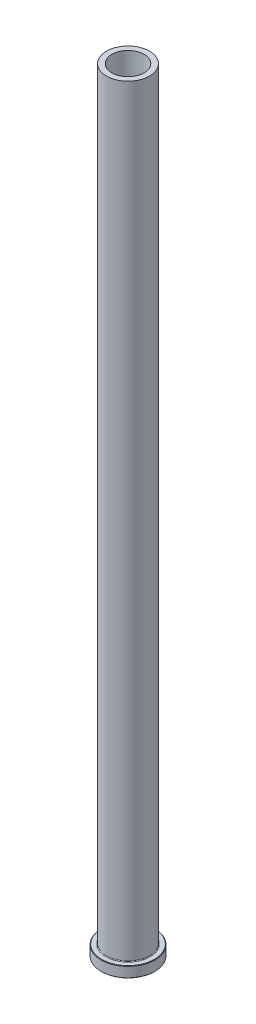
ISO-10303-21;
HEADER;
FILE_DESCRIPTION(('STEP AP214'),'2;1');
FILE_NAME('part.step','',(''),(''),'','','');
FILE_SCHEMA(('AUTOMOTIVE_DESIGN { 1 0 10303 214 1 1 1 1 }'));
ENDSEC;
DATA;
#1=APPLICATION_CONTEXT('core data for automotive mechanical design processes');
#2=APPLICATION_PROTOCOL_DEFINITION('international standard','automotive_design',2000,#1);
#3=PRODUCT_CONTEXT('',#1,'mechanical');
#4=PRODUCT('Part','Part','',(#3));
#5=PRODUCT_RELATED_PRODUCT_CATEGORY('part','',(#4));
#6=PRODUCT_DEFINITION_FORMATION('','',#4);
#7=PRODUCT_DEFINITION_CONTEXT('part definition',#1,'design');
#8=PRODUCT_DEFINITION('design','',#6,#7);
#9=PRODUCT_DEFINITION_SHAPE('','',#8);
#10=(LENGTH_UNIT() NAMED_UNIT(*) SI_UNIT(.MILLI.,.METRE.));
#11=(NAMED_UNIT(*) PLANE_ANGLE_UNIT() SI_UNIT($,.RADIAN.));
#12=(NAMED_UNIT(*) SI_UNIT($,.STERADIAN.) SOLID_ANGLE_UNIT());
#13=UNCERTAINTY_MEASURE_WITH_UNIT(LENGTH_MEASURE(1.E-05),#10,'distance_accuracy_value','');
#14=(GEOMETRIC_REPRESENTATION_CONTEXT(3) GLOBAL_UNCERTAINTY_ASSIGNED_CONTEXT((#13)) GLOBAL_UNIT_ASSIGNED_CONTEXT((#10,
#11,#12)) REPRESENTATION_CONTEXT('',''));
#15=CARTESIAN_POINT('',(0.,0.,0.));
#16=DIRECTION('',(0.,0.,1.));
#17=DIRECTION('',(1.,0.,0.));
#18=AXIS2_PLACEMENT_3D('',#15,#16,#17);
#19=CARTESIAN_POINT('',(0.,0.,0.));
#20=DIRECTION('',(0.,-1.,0.));
#21=DIRECTION('',(0.,0.,-1.));
#22=AXIS2_PLACEMENT_3D('',#19,#20,#21);
#23=PLANE('',#22);
#24=CARTESIAN_POINT('',(0.,0.,0.));
#25=DIRECTION('',(0.,-1.,0.));
#26=DIRECTION('',(0.,0.,-1.));
#27=AXIS2_PLACEMENT_3D('',#24,#25,#26);
#28=CIRCLE('',#27,15.621);
#29=CARTESIAN_POINT('',(0.,0.,-15.621));
#30=VERTEX_POINT('',#29);
#31=EDGE_CURVE('E45',#30,#30,#28,.T.);
#32=ORIENTED_EDGE('',*,*,#31,.T.);
#33=EDGE_LOOP('',(#32));
#34=FACE_BOUND('',#33,.T.);
#35=CARTESIAN_POINT('',(0.,0.,0.));
#36=DIRECTION('',(0.,-1.,0.));
#37=DIRECTION('',(0.,0.,-1.));
#38=AXIS2_PLACEMENT_3D('',#35,#36,#37);
#39=CIRCLE('',#38,10.112375);
#40=CARTESIAN_POINT('',(0.,0.,-10.112375));
#41=VERTEX_POINT('',#40);
#42=EDGE_CURVE('E59',#41,#41,#39,.T.);
#43=ORIENTED_EDGE('',*,*,#42,.F.);
#44=EDGE_LOOP('',(#43));
#45=FACE_BOUND('',#44,.T.);
#46=ADVANCED_FACE('F30',(#34,#45),#23,.T.);
#47=CARTESIAN_POINT('',(0.,0.,0.));
#48=DIRECTION('',(0.,-1.,0.));
#49=DIRECTION('',(0.,0.,-1.));
#50=AXIS2_PLACEMENT_3D('',#47,#48,#49);
#51=CYLINDRICAL_SURFACE('',#50,15.875);
#52=CARTESIAN_POINT('',(0.,0.254000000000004,0.));
#53=DIRECTION('',(0.,-1.,0.));
#54=DIRECTION('',(0.,0.,-1.));
#55=AXIS2_PLACEMENT_3D('',#52,#53,#54);
#56=CIRCLE('',#55,15.875);
#57=CARTESIAN_POINT('',(0.,0.254000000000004,-15.875));
#58=VERTEX_POINT('',#57);
#59=EDGE_CURVE('E37',#58,#58,#56,.F.);
#60=ORIENTED_EDGE('',*,*,#59,.T.);
#61=EDGE_LOOP('',(#60));
#62=FACE_BOUND('',#61,.T.);
#63=CARTESIAN_POINT('',(0.,6.09600000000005,0.));
#64=DIRECTION('',(0.,1.,0.));
#65=DIRECTION('',(0.,0.,1.));
#66=AXIS2_PLACEMENT_3D('',#63,#64,#65);
#67=CIRCLE('',#66,15.875);
#68=CARTESIAN_POINT('',(0.,6.09600000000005,15.875));
#69=VERTEX_POINT('',#68);
#70=EDGE_CURVE('E41',#69,#69,#67,.F.);
#71=ORIENTED_EDGE('',*,*,#70,.T.);
#72=EDGE_LOOP('',(#71));
#73=FACE_BOUND('',#72,.T.);
#74=ADVANCED_FACE('F104',(#62,#73),#51,.T.);
#75=CARTESIAN_POINT('',(15.875,6.35,0.));
#76=DIRECTION('',(0.,1.,0.));
#77=DIRECTION('',(0.,0.,1.));
#78=AXIS2_PLACEMENT_3D('',#75,#76,#77);
#79=PLANE('',#78);
#80=CARTESIAN_POINT('',(0.,6.35,0.));
#81=DIRECTION('',(0.,1.,0.));
#82=DIRECTION('',(0.,0.,1.));
#83=AXIS2_PLACEMENT_3D('',#80,#81,#82);
#84=CIRCLE('',#83,15.6210000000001);
#85=CARTESIAN_POINT('',(0.,6.35,15.6210000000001));
#86=VERTEX_POINT('',#85);
#87=EDGE_CURVE('E10',#86,#86,#84,.T.);
#88=ORIENTED_EDGE('',*,*,#87,.T.);
#89=EDGE_LOOP('',(#88));
#90=FACE_BOUND('',#89,.T.);
#91=CARTESIAN_POINT('',(0.,6.35,0.));
#92=DIRECTION('',(0.,-1.,0.));
#93=DIRECTION('',(0.,0.,-1.));
#94=AXIS2_PLACEMENT_3D('',#91,#92,#93);
#95=CIRCLE('',#94,13.154025);
#96=CARTESIAN_POINT('',(0.,6.35,-13.154025));
#97=VERTEX_POINT('',#96);
#98=EDGE_CURVE('E50',#97,#97,#95,.T.);
#99=ORIENTED_EDGE('',*,*,#98,.T.);
#100=EDGE_LOOP('',(#99));
#101=FACE_BOUND('',#100,.T.);
#102=ADVANCED_FACE('F110',(#90,#101),#79,.T.);
#103=CARTESIAN_POINT('',(0.,6.746875,0.));
#104=DIRECTION('',(0.,-1.,0.));
#105=DIRECTION('',(0.,0.,-1.));
#106=AXIS2_PLACEMENT_3D('',#103,#104,#105);
#107=TOROIDAL_SURFACE('',#106,13.154025,0.396875);
#108=CARTESIAN_POINT('',(0.,6.746875,0.));
#109=DIRECTION('',(0.,-1.,0.));
#110=DIRECTION('',(0.,0.,-1.));
#111=AXIS2_PLACEMENT_3D('',#108,#109,#110);
#112=CIRCLE('',#111,12.75715);
#113=CARTESIAN_POINT('',(0.,6.746875,-12.75715));
#114=VERTEX_POINT('',#113);
#115=EDGE_CURVE('E53',#114,#114,#112,.T.);
#116=ORIENTED_EDGE('',*,*,#115,.T.);
#117=EDGE_LOOP('',(#116));
#118=FACE_BOUND('',#117,.T.);
#119=ORIENTED_EDGE('',*,*,#98,.F.);
#120=EDGE_LOOP('',(#119));
#121=FACE_BOUND('',#120,.T.);
#122=ADVANCED_FACE('F140',(#118,#121),#107,.F.);
#123=CARTESIAN_POINT('',(0.,0.,0.));
#124=DIRECTION('',(0.,-1.,0.));
#125=DIRECTION('',(0.,0.,-1.));
#126=AXIS2_PLACEMENT_3D('',#123,#124,#125);
#127=CYLINDRICAL_SURFACE('',#126,12.75715);
#128=CARTESIAN_POINT('',(0.,457.2,0.));
#129=DIRECTION('',(0.,-1.,0.));
#130=DIRECTION('',(0.,0.,-1.));
#131=AXIS2_PLACEMENT_3D('',#128,#129,#130);
#132=CIRCLE('',#131,12.75715);
#133=CARTESIAN_POINT('',(0.,457.2,-12.75715));
#134=VERTEX_POINT('',#133);
#135=EDGE_CURVE('E56',#134,#134,#132,.T.);
#136=ORIENTED_EDGE('',*,*,#135,.T.);
#137=EDGE_LOOP('',(#136));
#138=FACE_BOUND('',#137,.T.);
#139=ORIENTED_EDGE('',*,*,#115,.F.);
#140=EDGE_LOOP('',(#139));
#141=FACE_BOUND('',#140,.T.);
#142=ADVANCED_FACE('F183',(#138,#141),#127,.T.);
#143=CARTESIAN_POINT('',(12.75715,457.2,0.));
#144=DIRECTION('',(0.,1.,0.));
#145=DIRECTION('',(0.,0.,1.));
#146=AXIS2_PLACEMENT_3D('',#143,#144,#145);
#147=PLANE('',#146);
#148=CARTESIAN_POINT('',(0.,457.2,0.));
#149=DIRECTION('',(0.,-1.,0.));
#150=DIRECTION('',(0.,0.,-1.));
#151=AXIS2_PLACEMENT_3D('',#148,#149,#150);
#152=CIRCLE('',#151,9.525);
#153=CARTESIAN_POINT('',(0.,457.2,-9.525));
#154=VERTEX_POINT('',#153);
#155=EDGE_CURVE('E71',#154,#154,#152,.T.);
#156=ORIENTED_EDGE('',*,*,#155,.T.);
#157=EDGE_LOOP('',(#156));
#158=FACE_BOUND('',#157,.T.);
#159=ORIENTED_EDGE('',*,*,#135,.F.);
#160=EDGE_LOOP('',(#159));
#161=FACE_BOUND('',#160,.T.);
#162=ADVANCED_FACE('F75',(#158,#161),#147,.T.);
#163=CARTESIAN_POINT('',(0.,0.,0.));
#164=DIRECTION('',(0.,-1.,0.));
#165=DIRECTION('',(0.,0.,-1.));
#166=AXIS2_PLACEMENT_3D('',#163,#164,#165);
#167=CONICAL_SURFACE('',#166,10.112375,0.785398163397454);
#168=CARTESIAN_POINT('',(0.,0.396875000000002,0.));
#169=DIRECTION('',(0.,-1.,0.));
#170=DIRECTION('',(0.,0.,-1.));
#171=AXIS2_PLACEMENT_3D('',#168,#169,#170);
#172=CIRCLE('',#171,9.7155);
#173=CARTESIAN_POINT('',(0.,0.396875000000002,-9.7155));
#174=VERTEX_POINT('',#173);
#175=EDGE_CURVE('E62',#174,#174,#172,.T.);
#176=ORIENTED_EDGE('',*,*,#175,.F.);
#177=EDGE_LOOP('',(#176));
#178=FACE_BOUND('',#177,.T.);
#179=ORIENTED_EDGE('',*,*,#42,.T.);
#180=EDGE_LOOP('',(#179));
#181=FACE_BOUND('',#180,.T.);
#182=ADVANCED_FACE('F94',(#178,#181),#167,.F.);
#183=CARTESIAN_POINT('',(0.,0.,0.));
#184=DIRECTION('',(0.,-1.,0.));
#185=DIRECTION('',(0.,0.,-1.));
#186=AXIS2_PLACEMENT_3D('',#183,#184,#185);
#187=CYLINDRICAL_SURFACE('',#186,9.7155);
#188=CARTESIAN_POINT('',(0.,360.3625,0.));
#189=DIRECTION('',(0.,-1.,0.));
#190=DIRECTION('',(0.,0.,-1.));
#191=AXIS2_PLACEMENT_3D('',#188,#189,#190);
#192=CIRCLE('',#191,9.7155);
#193=CARTESIAN_POINT('',(0.,360.3625,-9.7155));
#194=VERTEX_POINT('',#193);
#195=EDGE_CURVE('E65',#194,#194,#192,.T.);
#196=ORIENTED_EDGE('',*,*,#195,.F.);
#197=EDGE_LOOP('',(#196));
#198=FACE_BOUND('',#197,.T.);
#199=ORIENTED_EDGE('',*,*,#175,.T.);
#200=EDGE_LOOP('',(#199));
#201=FACE_BOUND('',#200,.T.);
#202=ADVANCED_FACE('F88',(#198,#201),#187,.F.);
#203=CARTESIAN_POINT('',(0.,360.3625,0.));
#204=DIRECTION('',(0.,-1.,0.));
#205=DIRECTION('',(0.,0.,-1.));
#206=AXIS2_PLACEMENT_3D('',#203,#204,#205);
#207=CONICAL_SURFACE('',#206,9.7155,0.0133325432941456);
#208=CARTESIAN_POINT('',(0.,374.65,0.));
#209=DIRECTION('',(0.,-1.,0.));
#210=DIRECTION('',(0.,0.,-1.));
#211=AXIS2_PLACEMENT_3D('',#208,#209,#210);
#212=CIRCLE('',#211,9.525);
#213=CARTESIAN_POINT('',(0.,374.65,-9.525));
#214=VERTEX_POINT('',#213);
#215=EDGE_CURVE('E68',#214,#214,#212,.T.);
#216=ORIENTED_EDGE('',*,*,#215,.F.);
#217=EDGE_LOOP('',(#216));
#218=FACE_BOUND('',#217,.T.);
#219=ORIENTED_EDGE('',*,*,#195,.T.);
#220=EDGE_LOOP('',(#219));
#221=FACE_BOUND('',#220,.T.);
#222=ADVANCED_FACE('F82',(#218,#221),#207,.F.);
#223=CARTESIAN_POINT('',(0.,0.,0.));
#224=DIRECTION('',(0.,-1.,0.));
#225=DIRECTION('',(0.,0.,-1.));
#226=AXIS2_PLACEMENT_3D('',#223,#224,#225);
#227=CYLINDRICAL_SURFACE('',#226,9.525);
#228=ORIENTED_EDGE('',*,*,#155,.F.);
#229=EDGE_LOOP('',(#228));
#230=FACE_BOUND('',#229,.T.);
#231=ORIENTED_EDGE('',*,*,#215,.T.);
#232=EDGE_LOOP('',(#231));
#233=FACE_BOUND('',#232,.T.);
#234=ADVANCED_FACE('F78',(#230,#233),#227,.F.);
#235=CARTESIAN_POINT('',(0.,0.,0.));
#236=DIRECTION('',(0.,1.,0.));
#237=DIRECTION('',(0.,0.,1.));
#238=AXIS2_PLACEMENT_3D('',#235,#236,#237);
#239=CONICAL_SURFACE('',#238,15.621,0.785398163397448);
#240=ORIENTED_EDGE('',*,*,#59,.F.);
#241=EDGE_LOOP('',(#240));
#242=FACE_BOUND('',#241,.T.);
#243=ORIENTED_EDGE('',*,*,#31,.F.);
#244=EDGE_LOOP('',(#243));
#245=FACE_BOUND('',#244,.T.);
#246=ADVANCED_FACE('F81',(#242,#245),#239,.T.);
#247=CARTESIAN_POINT('',(0.,6.09600000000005,0.));
#248=DIRECTION('',(0.,-1.,0.));
#249=DIRECTION('',(0.,0.,-1.));
#250=AXIS2_PLACEMENT_3D('',#247,#248,#249);
#251=CONICAL_SURFACE('',#250,15.875,0.785398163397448);
#252=ORIENTED_EDGE('',*,*,#87,.F.);
#253=EDGE_LOOP('',(#252));
#254=FACE_BOUND('',#253,.T.);
#255=ORIENTED_EDGE('',*,*,#70,.F.);
#256=EDGE_LOOP('',(#255));
#257=FACE_BOUND('',#256,.T.);
#258=ADVANCED_FACE('F32',(#254,#257),#251,.T.);
#259=CLOSED_SHELL('',(#46,#74,#102,#122,#142,#162,#182,#202,#222,#234,#246,#258));
#260=MANIFOLD_SOLID_BREP('B2',#259);
#261=ADVANCED_BREP_SHAPE_REPRESENTATION('',(#18,#260),#14);
#262=SHAPE_DEFINITION_REPRESENTATION(#9,#261);
ENDSEC;
END-ISO-10303-21;
